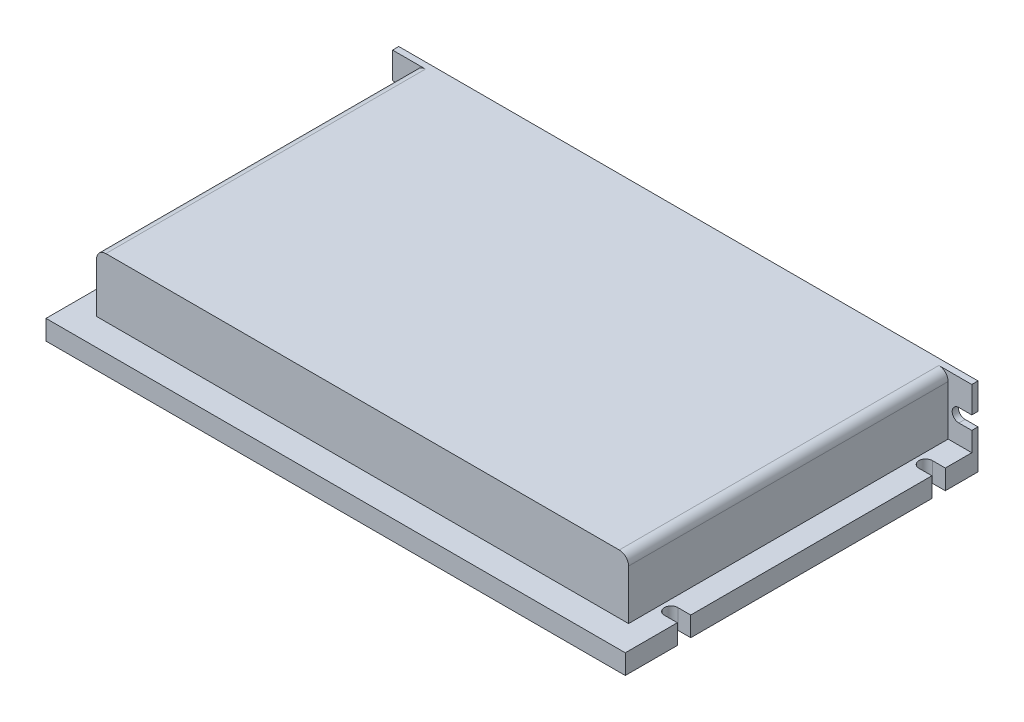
ISO-10303-21;
HEADER;
FILE_DESCRIPTION(('STEP AP214'),'2;1');
FILE_NAME('part.step','',(''),(''),'','','');
FILE_SCHEMA(('AUTOMOTIVE_DESIGN { 1 0 10303 214 1 1 1 1 }'));
ENDSEC;
DATA;
#1=APPLICATION_CONTEXT('core data for automotive mechanical design processes');
#2=APPLICATION_PROTOCOL_DEFINITION('international standard','automotive_design',2000,#1);
#3=PRODUCT_CONTEXT('',#1,'mechanical');
#4=PRODUCT('Part','Part','',(#3));
#5=PRODUCT_RELATED_PRODUCT_CATEGORY('part','',(#4));
#6=PRODUCT_DEFINITION_FORMATION('','',#4);
#7=PRODUCT_DEFINITION_CONTEXT('part definition',#1,'design');
#8=PRODUCT_DEFINITION('design','',#6,#7);
#9=PRODUCT_DEFINITION_SHAPE('','',#8);
#10=(LENGTH_UNIT() NAMED_UNIT(*) SI_UNIT(.MILLI.,.METRE.));
#11=(NAMED_UNIT(*) PLANE_ANGLE_UNIT() SI_UNIT($,.RADIAN.));
#12=(NAMED_UNIT(*) SI_UNIT($,.STERADIAN.) SOLID_ANGLE_UNIT());
#13=UNCERTAINTY_MEASURE_WITH_UNIT(LENGTH_MEASURE(1.E-05),#10,'distance_accuracy_value','');
#14=(GEOMETRIC_REPRESENTATION_CONTEXT(3) GLOBAL_UNCERTAINTY_ASSIGNED_CONTEXT((#13)) GLOBAL_UNIT_ASSIGNED_CONTEXT((#10,
#11,#12)) REPRESENTATION_CONTEXT('',''));
#15=CARTESIAN_POINT('',(0.,0.,0.));
#16=DIRECTION('',(0.,0.,1.));
#17=DIRECTION('',(1.,0.,0.));
#18=AXIS2_PLACEMENT_3D('',#15,#16,#17);
#19=CARTESIAN_POINT('',(126.69,-15.4,2.));
#20=DIRECTION('',(0.,-1.,0.));
#21=DIRECTION('',(1.,0.,0.));
#22=AXIS2_PLACEMENT_3D('',#19,#20,#21);
#23=PLANE('',#22);
#24=DIRECTION('',(0.,0.,-1.));
#25=VECTOR('',#24,1.);
#26=CARTESIAN_POINT('',(-60.,-15.4,2.));
#27=LINE('',#26,#25);
#28=CARTESIAN_POINT('',(-60.,-15.4,113.68));
#29=VERTEX_POINT('',#28);
#30=CARTESIAN_POINT('',(-60.,-15.4,96.9));
#31=VERTEX_POINT('',#30);
#32=EDGE_CURVE('E482',#29,#31,#27,.T.);
#33=ORIENTED_EDGE('',*,*,#32,.T.);
#34=DIRECTION('',(-1.,0.,0.));
#35=VECTOR('',#34,1.);
#36=CARTESIAN_POINT('',(-55.83,-15.4,96.9));
#37=LINE('',#36,#35);
#38=CARTESIAN_POINT('',(-55.83,-15.4,96.9));
#39=VERTEX_POINT('',#38);
#40=EDGE_CURVE('E270',#39,#31,#37,.T.);
#41=ORIENTED_EDGE('',*,*,#40,.F.);
#42=CARTESIAN_POINT('',(-55.83,-15.4,94.74));
#43=DIRECTION('',(0.,1.,0.));
#44=DIRECTION('',(-1.,0.,0.));
#45=AXIS2_PLACEMENT_3D('',#42,#43,#44);
#46=CIRCLE('',#45,2.16);
#47=CARTESIAN_POINT('',(-55.83,-15.4,92.58));
#48=VERTEX_POINT('',#47);
#49=EDGE_CURVE('E285',#39,#48,#46,.T.);
#50=ORIENTED_EDGE('',*,*,#49,.T.);
#51=DIRECTION('',(-1.,0.,0.));
#52=VECTOR('',#51,1.);
#53=CARTESIAN_POINT('',(-55.83,-15.4,92.58));
#54=LINE('',#53,#52);
#55=CARTESIAN_POINT('',(-60.,-15.4,92.58));
#56=VERTEX_POINT('',#55);
#57=EDGE_CURVE('E265',#48,#56,#54,.T.);
#58=ORIENTED_EDGE('',*,*,#57,.T.);
#59=CARTESIAN_POINT('',(-60.,-15.4,14.86));
#60=VERTEX_POINT('',#59);
#61=EDGE_CURVE('E486',#56,#60,#27,.T.);
#62=ORIENTED_EDGE('',*,*,#61,.T.);
#63=DIRECTION('',(-1.,0.,0.));
#64=VECTOR('',#63,1.);
#65=CARTESIAN_POINT('',(-55.83,-15.4,14.86));
#66=LINE('',#65,#64);
#67=CARTESIAN_POINT('',(-55.83,-15.4,14.86));
#68=VERTEX_POINT('',#67);
#69=EDGE_CURVE('E307',#68,#60,#66,.T.);
#70=ORIENTED_EDGE('',*,*,#69,.F.);
#71=CARTESIAN_POINT('',(-55.83,-15.4,12.7));
#72=DIRECTION('',(0.,1.,0.));
#73=DIRECTION('',(-1.,0.,0.));
#74=AXIS2_PLACEMENT_3D('',#71,#72,#73);
#75=CIRCLE('',#74,2.16);
#76=CARTESIAN_POINT('',(-55.83,-15.4,10.54));
#77=VERTEX_POINT('',#76);
#78=EDGE_CURVE('E301',#68,#77,#75,.T.);
#79=ORIENTED_EDGE('',*,*,#78,.T.);
#80=DIRECTION('',(-1.,0.,0.));
#81=VECTOR('',#80,1.);
#82=CARTESIAN_POINT('',(-55.83,-15.4,10.54));
#83=LINE('',#82,#81);
#84=CARTESIAN_POINT('',(-60.,-15.4,10.54));
#85=VERTEX_POINT('',#84);
#86=EDGE_CURVE('E304',#77,#85,#83,.T.);
#87=ORIENTED_EDGE('',*,*,#86,.T.);
#88=CARTESIAN_POINT('',(-60.,-15.4,0.));
#89=VERTEX_POINT('',#88);
#90=EDGE_CURVE('E480',#85,#89,#27,.T.);
#91=ORIENTED_EDGE('',*,*,#90,.T.);
#92=DIRECTION('',(-1.,0.,0.));
#93=VECTOR('',#92,1.);
#94=CARTESIAN_POINT('',(126.69,-15.4,0.));
#95=LINE('',#94,#93);
#96=CARTESIAN_POINT('',(126.69,-15.4,0.));
#97=VERTEX_POINT('',#96);
#98=EDGE_CURVE('E521',#97,#89,#95,.T.);
#99=ORIENTED_EDGE('',*,*,#98,.F.);
#100=DIRECTION('',(0.,0.,-1.));
#101=VECTOR('',#100,1.);
#102=CARTESIAN_POINT('',(126.69,-15.4,2.));
#103=LINE('',#102,#101);
#104=CARTESIAN_POINT('',(126.69,-15.4,10.54));
#105=VERTEX_POINT('',#104);
#106=EDGE_CURVE('E476',#105,#97,#103,.T.);
#107=ORIENTED_EDGE('',*,*,#106,.F.);
#108=DIRECTION('',(1.,0.,0.));
#109=VECTOR('',#108,1.);
#110=CARTESIAN_POINT('',(122.52,-15.4,10.54));
#111=LINE('',#110,#109);
#112=CARTESIAN_POINT('',(122.52,-15.4,10.54));
#113=VERTEX_POINT('',#112);
#114=EDGE_CURVE('E332',#113,#105,#111,.T.);
#115=ORIENTED_EDGE('',*,*,#114,.F.);
#116=CARTESIAN_POINT('',(122.52,-15.4,12.7));
#117=DIRECTION('',(0.,1.,0.));
#118=DIRECTION('',(-1.,0.,0.));
#119=AXIS2_PLACEMENT_3D('',#116,#117,#118);
#120=CIRCLE('',#119,2.16);
#121=CARTESIAN_POINT('',(122.52,-15.4,14.86));
#122=VERTEX_POINT('',#121);
#123=EDGE_CURVE('E326',#113,#122,#120,.T.);
#124=ORIENTED_EDGE('',*,*,#123,.T.);
#125=DIRECTION('',(1.,0.,0.));
#126=VECTOR('',#125,1.);
#127=CARTESIAN_POINT('',(122.52,-15.4,14.86));
#128=LINE('',#127,#126);
#129=CARTESIAN_POINT('',(126.69,-15.4,14.86));
#130=VERTEX_POINT('',#129);
#131=EDGE_CURVE('E329',#122,#130,#128,.T.);
#132=ORIENTED_EDGE('',*,*,#131,.T.);
#133=CARTESIAN_POINT('',(126.69,-15.4,92.58));
#134=VERTEX_POINT('',#133);
#135=EDGE_CURVE('E481',#134,#130,#103,.T.);
#136=ORIENTED_EDGE('',*,*,#135,.F.);
#137=DIRECTION('',(1.,0.,0.));
#138=VECTOR('',#137,1.);
#139=CARTESIAN_POINT('',(122.52,-15.4,92.58));
#140=LINE('',#139,#138);
#141=CARTESIAN_POINT('',(122.52,-15.4,92.58));
#142=VERTEX_POINT('',#141);
#143=EDGE_CURVE('E357',#142,#134,#140,.T.);
#144=ORIENTED_EDGE('',*,*,#143,.F.);
#145=CARTESIAN_POINT('',(122.52,-15.4,94.74));
#146=DIRECTION('',(0.,1.,0.));
#147=DIRECTION('',(-1.,0.,0.));
#148=AXIS2_PLACEMENT_3D('',#145,#146,#147);
#149=CIRCLE('',#148,2.16);
#150=CARTESIAN_POINT('',(122.52,-15.4,96.9));
#151=VERTEX_POINT('',#150);
#152=EDGE_CURVE('E351',#142,#151,#149,.T.);
#153=ORIENTED_EDGE('',*,*,#152,.T.);
#154=DIRECTION('',(1.,0.,0.));
#155=VECTOR('',#154,1.);
#156=CARTESIAN_POINT('',(122.52,-15.4,96.9));
#157=LINE('',#156,#155);
#158=CARTESIAN_POINT('',(126.69,-15.4,96.9));
#159=VERTEX_POINT('',#158);
#160=EDGE_CURVE('E354',#151,#159,#157,.T.);
#161=ORIENTED_EDGE('',*,*,#160,.T.);
#162=CARTESIAN_POINT('',(126.69,-15.4,113.68));
#163=VERTEX_POINT('',#162);
#164=EDGE_CURVE('E477',#163,#159,#103,.T.);
#165=ORIENTED_EDGE('',*,*,#164,.F.);
#166=DIRECTION('',(1.,0.,0.));
#167=VECTOR('',#166,1.);
#168=CARTESIAN_POINT('',(-60.,-15.4,113.68));
#169=LINE('',#168,#167);
#170=EDGE_CURVE('E432',#29,#163,#169,.T.);
#171=ORIENTED_EDGE('',*,*,#170,.F.);
#172=EDGE_LOOP('',(#33,#41,#50,#58,#62,#70,#79,#87,#91,#99,#107,#115,#124,#132,#136,#144,#153,
#161,#165,#171));
#173=FACE_BOUND('',#172,.T.);
#174=ADVANCED_FACE('F28',(#173),#23,.T.);
#175=CARTESIAN_POINT('',(126.69,-9.05000000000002,113.68));
#176=DIRECTION('',(0.,-1.,0.));
#177=DIRECTION('',(1.,0.,0.));
#178=AXIS2_PLACEMENT_3D('',#175,#176,#177);
#179=PLANE('',#178);
#180=DIRECTION('',(-1.,0.,0.));
#181=VECTOR('',#180,1.);
#182=CARTESIAN_POINT('',(-55.83,-9.05,96.9));
#183=LINE('',#182,#181);
#184=CARTESIAN_POINT('',(-55.83,-9.05,96.9));
#185=VERTEX_POINT('',#184);
#186=CARTESIAN_POINT('',(-60.,-9.05,96.9));
#187=VERTEX_POINT('',#186);
#188=EDGE_CURVE('E283',#185,#187,#183,.T.);
#189=ORIENTED_EDGE('',*,*,#188,.T.);
#190=DIRECTION('',(0.,0.,-1.));
#191=VECTOR('',#190,1.);
#192=CARTESIAN_POINT('',(-60.,-9.05,113.68));
#193=LINE('',#192,#191);
#194=CARTESIAN_POINT('',(-60.,-9.05,113.68));
#195=VERTEX_POINT('',#194);
#196=EDGE_CURVE('E430',#195,#187,#193,.T.);
#197=ORIENTED_EDGE('',*,*,#196,.F.);
#198=DIRECTION('',(-1.,0.,0.));
#199=VECTOR('',#198,1.);
#200=CARTESIAN_POINT('',(126.69,-9.05000000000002,113.68));
#201=LINE('',#200,#199);
#202=CARTESIAN_POINT('',(126.69,-9.05000000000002,113.68));
#203=VERTEX_POINT('',#202);
#204=EDGE_CURVE('E893',#203,#195,#201,.T.);
#205=ORIENTED_EDGE('',*,*,#204,.F.);
#206=DIRECTION('',(0.,0.,-1.));
#207=VECTOR('',#206,1.);
#208=CARTESIAN_POINT('',(126.69,-9.05000000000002,113.68));
#209=LINE('',#208,#207);
#210=CARTESIAN_POINT('',(126.69,-9.05000000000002,96.9));
#211=VERTEX_POINT('',#210);
#212=EDGE_CURVE('E428',#203,#211,#209,.T.);
#213=ORIENTED_EDGE('',*,*,#212,.T.);
#214=DIRECTION('',(1.,0.,0.));
#215=VECTOR('',#214,1.);
#216=CARTESIAN_POINT('',(122.52,-9.05000000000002,96.9));
#217=LINE('',#216,#215);
#218=CARTESIAN_POINT('',(122.52,-9.05000000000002,96.9));
#219=VERTEX_POINT('',#218);
#220=EDGE_CURVE('E346',#219,#211,#217,.T.);
#221=ORIENTED_EDGE('',*,*,#220,.F.);
#222=CARTESIAN_POINT('',(122.52,-9.05000000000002,94.74));
#223=DIRECTION('',(0.,1.,0.));
#224=DIRECTION('',(-1.,0.,0.));
#225=AXIS2_PLACEMENT_3D('',#222,#223,#224);
#226=CIRCLE('',#225,2.16);
#227=CARTESIAN_POINT('',(122.52,-9.05000000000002,92.58));
#228=VERTEX_POINT('',#227);
#229=EDGE_CURVE('E344',#228,#219,#226,.T.);
#230=ORIENTED_EDGE('',*,*,#229,.F.);
#231=DIRECTION('',(1.,0.,0.));
#232=VECTOR('',#231,1.);
#233=CARTESIAN_POINT('',(122.52,-9.05000000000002,92.58));
#234=LINE('',#233,#232);
#235=CARTESIAN_POINT('',(126.69,-9.05000000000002,92.58));
#236=VERTEX_POINT('',#235);
#237=EDGE_CURVE('E348',#228,#236,#234,.T.);
#238=ORIENTED_EDGE('',*,*,#237,.T.);
#239=CARTESIAN_POINT('',(126.69,-9.05000000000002,14.86));
#240=VERTEX_POINT('',#239);
#241=EDGE_CURVE('E425',#236,#240,#209,.T.);
#242=ORIENTED_EDGE('',*,*,#241,.T.);
#243=DIRECTION('',(1.,0.,0.));
#244=VECTOR('',#243,1.);
#245=CARTESIAN_POINT('',(122.52,-9.05000000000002,14.86));
#246=LINE('',#245,#244);
#247=CARTESIAN_POINT('',(122.52,-9.05000000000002,14.86));
#248=VERTEX_POINT('',#247);
#249=EDGE_CURVE('E321',#248,#240,#246,.T.);
#250=ORIENTED_EDGE('',*,*,#249,.F.);
#251=CARTESIAN_POINT('',(122.52,-9.05000000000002,12.7));
#252=DIRECTION('',(0.,1.,0.));
#253=DIRECTION('',(-1.,0.,0.));
#254=AXIS2_PLACEMENT_3D('',#251,#252,#253);
#255=CIRCLE('',#254,2.16);
#256=CARTESIAN_POINT('',(122.52,-9.05000000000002,10.54));
#257=VERTEX_POINT('',#256);
#258=EDGE_CURVE('E319',#257,#248,#255,.T.);
#259=ORIENTED_EDGE('',*,*,#258,.F.);
#260=DIRECTION('',(1.,0.,0.));
#261=VECTOR('',#260,1.);
#262=CARTESIAN_POINT('',(122.52,-9.05000000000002,10.54));
#263=LINE('',#262,#261);
#264=CARTESIAN_POINT('',(126.69,-9.05000000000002,10.54));
#265=VERTEX_POINT('',#264);
#266=EDGE_CURVE('E323',#257,#265,#263,.T.);
#267=ORIENTED_EDGE('',*,*,#266,.T.);
#268=CARTESIAN_POINT('',(126.69,-9.05000000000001,2.));
#269=VERTEX_POINT('',#268);
#270=EDGE_CURVE('E429',#265,#269,#209,.T.);
#271=ORIENTED_EDGE('',*,*,#270,.T.);
#272=DIRECTION('',(-1.,0.,0.));
#273=VECTOR('',#272,1.);
#274=CARTESIAN_POINT('',(126.69,-9.05000000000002,2.));
#275=LINE('',#274,#273);
#276=CARTESIAN_POINT('',(119.07,-9.05000000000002,2.));
#277=VERTEX_POINT('',#276);
#278=EDGE_CURVE('E418',#269,#277,#275,.T.);
#279=ORIENTED_EDGE('',*,*,#278,.T.);
#280=DIRECTION('',(0.,0.,-1.));
#281=VECTOR('',#280,1.);
#282=CARTESIAN_POINT('',(119.07,-9.05000000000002,105.));
#283=LINE('',#282,#281);
#284=CARTESIAN_POINT('',(119.07,-9.05000000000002,105.));
#285=VERTEX_POINT('',#284);
#286=EDGE_CURVE('E406',#285,#277,#283,.T.);
#287=ORIENTED_EDGE('',*,*,#286,.F.);
#288=DIRECTION('',(1.,0.,0.));
#289=VECTOR('',#288,1.);
#290=CARTESIAN_POINT('',(-52.38,-9.05000000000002,105.));
#291=LINE('',#290,#289);
#292=CARTESIAN_POINT('',(-52.38,-9.05,105.));
#293=VERTEX_POINT('',#292);
#294=EDGE_CURVE('E395',#293,#285,#291,.T.);
#295=ORIENTED_EDGE('',*,*,#294,.F.);
#296=DIRECTION('',(0.,0.,-1.));
#297=VECTOR('',#296,1.);
#298=CARTESIAN_POINT('',(-52.38,-9.05000000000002,105.));
#299=LINE('',#298,#297);
#300=CARTESIAN_POINT('',(-52.38,-9.05000000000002,2.));
#301=VERTEX_POINT('',#300);
#302=EDGE_CURVE('E408',#293,#301,#299,.T.);
#303=ORIENTED_EDGE('',*,*,#302,.T.);
#304=CARTESIAN_POINT('',(-60.,-9.05,2.));
#305=VERTEX_POINT('',#304);
#306=EDGE_CURVE('E411',#301,#305,#275,.T.);
#307=ORIENTED_EDGE('',*,*,#306,.T.);
#308=CARTESIAN_POINT('',(-60.,-9.05,10.54));
#309=VERTEX_POINT('',#308);
#310=EDGE_CURVE('E431',#309,#305,#193,.T.);
#311=ORIENTED_EDGE('',*,*,#310,.F.);
#312=DIRECTION('',(-1.,0.,0.));
#313=VECTOR('',#312,1.);
#314=CARTESIAN_POINT('',(-55.83,-9.05,10.54));
#315=LINE('',#314,#313);
#316=CARTESIAN_POINT('',(-55.83,-9.05,10.54));
#317=VERTEX_POINT('',#316);
#318=EDGE_CURVE('E54',#317,#309,#315,.T.);
#319=ORIENTED_EDGE('',*,*,#318,.F.);
#320=CARTESIAN_POINT('',(-55.83,-9.05,12.7));
#321=DIRECTION('',(0.,1.,0.));
#322=DIRECTION('',(-1.,0.,0.));
#323=AXIS2_PLACEMENT_3D('',#320,#321,#322);
#324=CIRCLE('',#323,2.16);
#325=CARTESIAN_POINT('',(-55.83,-9.05,14.86));
#326=VERTEX_POINT('',#325);
#327=EDGE_CURVE('E295',#326,#317,#324,.T.);
#328=ORIENTED_EDGE('',*,*,#327,.F.);
#329=DIRECTION('',(-1.,0.,0.));
#330=VECTOR('',#329,1.);
#331=CARTESIAN_POINT('',(-55.83,-9.05,14.86));
#332=LINE('',#331,#330);
#333=CARTESIAN_POINT('',(-60.,-9.05,14.86));
#334=VERTEX_POINT('',#333);
#335=EDGE_CURVE('E299',#326,#334,#332,.T.);
#336=ORIENTED_EDGE('',*,*,#335,.T.);
#337=CARTESIAN_POINT('',(-60.,-9.05,92.58));
#338=VERTEX_POINT('',#337);
#339=EDGE_CURVE('E32',#338,#334,#193,.T.);
#340=ORIENTED_EDGE('',*,*,#339,.F.);
#341=DIRECTION('',(-1.,0.,0.));
#342=VECTOR('',#341,1.);
#343=CARTESIAN_POINT('',(-55.83,-9.05,92.58));
#344=LINE('',#343,#342);
#345=CARTESIAN_POINT('',(-55.83,-9.05,92.58));
#346=VERTEX_POINT('',#345);
#347=EDGE_CURVE('E46',#346,#338,#344,.T.);
#348=ORIENTED_EDGE('',*,*,#347,.F.);
#349=CARTESIAN_POINT('',(-55.83,-9.05,94.74));
#350=DIRECTION('',(0.,1.,0.));
#351=DIRECTION('',(-1.,0.,0.));
#352=AXIS2_PLACEMENT_3D('',#349,#350,#351);
#353=CIRCLE('',#352,2.16);
#354=EDGE_CURVE('E273',#185,#346,#353,.T.);
#355=ORIENTED_EDGE('',*,*,#354,.F.);
#356=EDGE_LOOP('',(#189,#197,#205,#213,#221,#230,#238,#242,#250,#259,#267,#271,#279,#287,#295,
#303,#307,#311,#319,#328,#336,#340,#348,#355));
#357=FACE_BOUND('',#356,.T.);
#358=ADVANCED_FACE('F281',(#357),#179,.F.);
#359=CARTESIAN_POINT('',(-60.,-2.825,2.));
#360=DIRECTION('',(1.,0.,0.));
#361=DIRECTION('',(0.,1.,0.));
#362=AXIS2_PLACEMENT_3D('',#359,#360,#361);
#363=PLANE('',#362);
#364=DIRECTION('',(0.,1.,0.));
#365=VECTOR('',#364,1.);
#366=CARTESIAN_POINT('',(-60.,-15.4,96.9));
#367=LINE('',#366,#365);
#368=EDGE_CURVE('E292',#31,#187,#367,.T.);
#369=ORIENTED_EDGE('',*,*,#368,.F.);
#370=ORIENTED_EDGE('',*,*,#32,.F.);
#371=DIRECTION('',(0.,1.,0.));
#372=VECTOR('',#371,1.);
#373=CARTESIAN_POINT('',(-60.,-15.4,113.68));
#374=LINE('',#373,#372);
#375=EDGE_CURVE('E414',#29,#195,#374,.T.);
#376=ORIENTED_EDGE('',*,*,#375,.T.);
#377=ORIENTED_EDGE('',*,*,#196,.T.);
#378=EDGE_LOOP('',(#369,#370,#376,#377));
#379=FACE_BOUND('',#378,.T.);
#380=ADVANCED_FACE('F591',(#379),#363,.F.);
#381=ORIENTED_EDGE('',*,*,#61,.F.);
#382=DIRECTION('',(0.,1.,0.));
#383=VECTOR('',#382,1.);
#384=CARTESIAN_POINT('',(-60.,-15.4,92.58));
#385=LINE('',#384,#383);
#386=EDGE_CURVE('E269',#56,#338,#385,.T.);
#387=ORIENTED_EDGE('',*,*,#386,.T.);
#388=ORIENTED_EDGE('',*,*,#339,.T.);
#389=DIRECTION('',(0.,1.,0.));
#390=VECTOR('',#389,1.);
#391=CARTESIAN_POINT('',(-60.,-15.4,14.86));
#392=LINE('',#391,#390);
#393=EDGE_CURVE('E314',#60,#334,#392,.T.);
#394=ORIENTED_EDGE('',*,*,#393,.F.);
#395=EDGE_LOOP('',(#381,#387,#388,#394));
#396=FACE_BOUND('',#395,.T.);
#397=ADVANCED_FACE('F588',(#396),#363,.F.);
#398=CARTESIAN_POINT('',(126.69,-15.4,2.));
#399=DIRECTION('',(-1.,0.,0.));
#400=DIRECTION('',(0.,-1.,0.));
#401=AXIS2_PLACEMENT_3D('',#398,#399,#400);
#402=PLANE('',#401);
#403=DIRECTION('',(0.,1.,0.));
#404=VECTOR('',#403,1.);
#405=CARTESIAN_POINT('',(126.69,-15.4,10.54));
#406=LINE('',#405,#404);
#407=EDGE_CURVE('E340',#105,#265,#406,.T.);
#408=ORIENTED_EDGE('',*,*,#407,.F.);
#409=ORIENTED_EDGE('',*,*,#106,.T.);
#410=DIRECTION('',(0.,1.,0.));
#411=VECTOR('',#410,1.);
#412=CARTESIAN_POINT('',(126.69,-15.4,0.));
#413=LINE('',#412,#411);
#414=CARTESIAN_POINT('',(126.69,-2.825,0.));
#415=VERTEX_POINT('',#414);
#416=EDGE_CURVE('E524',#97,#415,#413,.T.);
#417=ORIENTED_EDGE('',*,*,#416,.T.);
#418=DIRECTION('',(0.,0.,-1.));
#419=VECTOR('',#418,1.);
#420=CARTESIAN_POINT('',(126.69,-2.825,2.));
#421=LINE('',#420,#419);
#422=CARTESIAN_POINT('',(126.69,-2.825,2.));
#423=VERTEX_POINT('',#422);
#424=EDGE_CURVE('E474',#423,#415,#421,.T.);
#425=ORIENTED_EDGE('',*,*,#424,.F.);
#426=DIRECTION('',(0.,1.,0.));
#427=VECTOR('',#426,1.);
#428=CARTESIAN_POINT('',(126.69,-15.4,2.));
#429=LINE('',#428,#427);
#430=EDGE_CURVE('E439',#269,#423,#429,.T.);
#431=ORIENTED_EDGE('',*,*,#430,.F.);
#432=ORIENTED_EDGE('',*,*,#270,.F.);
#433=EDGE_LOOP('',(#408,#409,#417,#425,#431,#432));
#434=FACE_BOUND('',#433,.T.);
#435=ADVANCED_FACE('F590',(#434),#402,.F.);
#436=ORIENTED_EDGE('',*,*,#135,.T.);
#437=DIRECTION('',(0.,1.,0.));
#438=VECTOR('',#437,1.);
#439=CARTESIAN_POINT('',(126.69,-15.4,14.86));
#440=LINE('',#439,#438);
#441=EDGE_CURVE('E337',#130,#240,#440,.T.);
#442=ORIENTED_EDGE('',*,*,#441,.T.);
#443=ORIENTED_EDGE('',*,*,#241,.F.);
#444=DIRECTION('',(0.,1.,0.));
#445=VECTOR('',#444,1.);
#446=CARTESIAN_POINT('',(126.69,-15.4,92.58));
#447=LINE('',#446,#445);
#448=EDGE_CURVE('E365',#134,#236,#447,.T.);
#449=ORIENTED_EDGE('',*,*,#448,.F.);
#450=EDGE_LOOP('',(#436,#442,#443,#449));
#451=FACE_BOUND('',#450,.T.);
#452=ADVANCED_FACE('F597',(#451),#402,.F.);
#453=CARTESIAN_POINT('',(-55.83,-0.669999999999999,2.));
#454=DIRECTION('',(0.,0.,1.));
#455=DIRECTION('',(1.,0.,0.));
#456=AXIS2_PLACEMENT_3D('',#453,#454,#455);
#457=PLANE('',#456);
#458=DIRECTION('',(0.,-1.,0.));
#459=VECTOR('',#458,1.);
#460=CARTESIAN_POINT('',(119.07,6.99999999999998,2.));
#461=LINE('',#460,#459);
#462=CARTESIAN_POINT('',(119.07,6.99999999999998,2.));
#463=VERTEX_POINT('',#462);
#464=EDGE_CURVE('E378',#463,#277,#461,.T.);
#465=ORIENTED_EDGE('',*,*,#464,.T.);
#466=ORIENTED_EDGE('',*,*,#278,.F.);
#467=ORIENTED_EDGE('',*,*,#430,.T.);
#468=DIRECTION('',(1.,0.,0.));
#469=VECTOR('',#468,1.);
#470=CARTESIAN_POINT('',(122.52,-2.825,2.));
#471=LINE('',#470,#469);
#472=CARTESIAN_POINT('',(122.52,-2.82500000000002,2.));
#473=VERTEX_POINT('',#472);
#474=EDGE_CURVE('E442',#473,#423,#471,.T.);
#475=ORIENTED_EDGE('',*,*,#474,.F.);
#476=CARTESIAN_POINT('',(122.52,-0.670000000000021,2.));
#477=DIRECTION('',(0.,0.,1.));
#478=DIRECTION('',(1.,0.,0.));
#479=AXIS2_PLACEMENT_3D('',#476,#477,#478);
#480=CIRCLE('',#479,2.155);
#481=CARTESIAN_POINT('',(122.52,1.485,2.));
#482=VERTEX_POINT('',#481);
#483=EDGE_CURVE('E451',#482,#473,#480,.T.);
#484=ORIENTED_EDGE('',*,*,#483,.F.);
#485=DIRECTION('',(1.,0.,0.));
#486=VECTOR('',#485,1.);
#487=CARTESIAN_POINT('',(122.52,1.485,2.));
#488=LINE('',#487,#486);
#489=CARTESIAN_POINT('',(126.69,1.485,2.));
#490=VERTEX_POINT('',#489);
#491=EDGE_CURVE('E454',#482,#490,#488,.T.);
#492=ORIENTED_EDGE('',*,*,#491,.T.);
#493=DIRECTION('',(0.,1.,0.));
#494=VECTOR('',#493,1.);
#495=CARTESIAN_POINT('',(126.69,1.485,2.));
#496=LINE('',#495,#494);
#497=CARTESIAN_POINT('',(126.69,10.,2.));
#498=VERTEX_POINT('',#497);
#499=EDGE_CURVE('E457',#490,#498,#496,.T.);
#500=ORIENTED_EDGE('',*,*,#499,.T.);
#501=DIRECTION('',(1.,0.,0.));
#502=VECTOR('',#501,1.);
#503=CARTESIAN_POINT('',(-60.,10.,2.));
#504=LINE('',#503,#502);
#505=CARTESIAN_POINT('',(116.07,10.,2.));
#506=VERTEX_POINT('',#505);
#507=EDGE_CURVE('E460',#506,#498,#504,.T.);
#508=ORIENTED_EDGE('',*,*,#507,.F.);
#509=CARTESIAN_POINT('',(116.07,7.,2.));
#510=DIRECTION('',(0.,0.,1.));
#511=DIRECTION('',(1.,0.,0.));
#512=AXIS2_PLACEMENT_3D('',#509,#510,#511);
#513=CIRCLE('',#512,3.);
#514=EDGE_CURVE('E375',#463,#506,#513,.T.);
#515=ORIENTED_EDGE('',*,*,#514,.F.);
#516=EDGE_LOOP('',(#465,#466,#467,#475,#484,#492,#500,#508,#515));
#517=FACE_BOUND('',#516,.T.);
#518=ADVANCED_FACE('F633',(#517),#457,.T.);
#519=CARTESIAN_POINT('',(-60.,10.,2.));
#520=DIRECTION('',(1.,0.,0.));
#521=DIRECTION('',(0.,1.,0.));
#522=AXIS2_PLACEMENT_3D('',#519,#520,#521);
#523=PLANE('',#522);
#524=DIRECTION('',(0.,0.,-1.));
#525=VECTOR('',#524,1.);
#526=CARTESIAN_POINT('',(-60.,1.485,2.));
#527=LINE('',#526,#525);
#528=CARTESIAN_POINT('',(-60.,1.485,2.));
#529=VERTEX_POINT('',#528);
#530=CARTESIAN_POINT('',(-60.,1.485,0.));
#531=VERTEX_POINT('',#530);
#532=EDGE_CURVE('E11',#529,#531,#527,.T.);
#533=ORIENTED_EDGE('',*,*,#532,.F.);
#534=DIRECTION('',(0.,-1.,0.));
#535=VECTOR('',#534,1.);
#536=CARTESIAN_POINT('',(-60.,10.,2.));
#537=LINE('',#536,#535);
#538=CARTESIAN_POINT('',(-60.,10.,2.));
#539=VERTEX_POINT('',#538);
#540=EDGE_CURVE('E542',#539,#529,#537,.T.);
#541=ORIENTED_EDGE('',*,*,#540,.F.);
#542=DIRECTION('',(0.,0.,-1.));
#543=VECTOR('',#542,1.);
#544=CARTESIAN_POINT('',(-60.,10.,2.));
#545=LINE('',#544,#543);
#546=CARTESIAN_POINT('',(-60.,10.,0.));
#547=VERTEX_POINT('',#546);
#548=EDGE_CURVE('E464',#539,#547,#545,.T.);
#549=ORIENTED_EDGE('',*,*,#548,.T.);
#550=DIRECTION('',(0.,-1.,0.));
#551=VECTOR('',#550,1.);
#552=CARTESIAN_POINT('',(-60.,10.,0.));
#553=LINE('',#552,#551);
#554=EDGE_CURVE('E508',#547,#531,#553,.T.);
#555=ORIENTED_EDGE('',*,*,#554,.T.);
#556=EDGE_LOOP('',(#533,#541,#549,#555));
#557=FACE_BOUND('',#556,.T.);
#558=ADVANCED_FACE('F574',(#557),#523,.F.);
#559=CARTESIAN_POINT('',(-55.83,1.485,2.));
#560=DIRECTION('',(0.,-1.,0.));
#561=DIRECTION('',(1.,0.,0.));
#562=AXIS2_PLACEMENT_3D('',#559,#560,#561);
#563=PLANE('',#562);
#564=DIRECTION('',(0.,0.,-1.));
#565=VECTOR('',#564,1.);
#566=CARTESIAN_POINT('',(-55.83,1.485,2.));
#567=LINE('',#566,#565);
#568=CARTESIAN_POINT('',(-55.83,1.485,2.));
#569=VERTEX_POINT('',#568);
#570=CARTESIAN_POINT('',(-55.83,1.485,0.));
#571=VERTEX_POINT('',#570);
#572=EDGE_CURVE('E38',#569,#571,#567,.T.);
#573=ORIENTED_EDGE('',*,*,#572,.F.);
#574=DIRECTION('',(-1.,0.,0.));
#575=VECTOR('',#574,1.);
#576=CARTESIAN_POINT('',(-55.83,1.485,2.));
#577=LINE('',#576,#575);
#578=EDGE_CURVE('E545',#569,#529,#577,.T.);
#579=ORIENTED_EDGE('',*,*,#578,.T.);
#580=ORIENTED_EDGE('',*,*,#532,.T.);
#581=DIRECTION('',(-1.,0.,0.));
#582=VECTOR('',#581,1.);
#583=CARTESIAN_POINT('',(-55.83,1.485,0.));
#584=LINE('',#583,#582);
#585=EDGE_CURVE('E504',#571,#531,#584,.T.);
#586=ORIENTED_EDGE('',*,*,#585,.F.);
#587=EDGE_LOOP('',(#573,#579,#580,#586));
#588=FACE_BOUND('',#587,.T.);
#589=ADVANCED_FACE('F30',(#588),#563,.T.);
#590=CARTESIAN_POINT('',(-55.83,-0.669999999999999,2.));
#591=DIRECTION('',(0.,0.,-1.));
#592=DIRECTION('',(-1.,0.,0.));
#593=AXIS2_PLACEMENT_3D('',#590,#591,#592);
#594=CYLINDRICAL_SURFACE('',#593,2.155);
#595=DIRECTION('',(0.,0.,-1.));
#596=VECTOR('',#595,1.);
#597=CARTESIAN_POINT('',(-55.83,-2.825,2.));
#598=LINE('',#597,#596);
#599=CARTESIAN_POINT('',(-55.83,-2.825,2.));
#600=VERTEX_POINT('',#599);
#601=CARTESIAN_POINT('',(-55.83,-2.825,0.));
#602=VERTEX_POINT('',#601);
#603=EDGE_CURVE('E488',#600,#602,#598,.T.);
#604=ORIENTED_EDGE('',*,*,#603,.F.);
#605=CARTESIAN_POINT('',(-55.83,-0.669999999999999,2.));
#606=DIRECTION('',(0.,0.,1.));
#607=DIRECTION('',(1.,0.,0.));
#608=AXIS2_PLACEMENT_3D('',#605,#606,#607);
#609=CIRCLE('',#608,2.155);
#610=EDGE_CURVE('E499',#600,#569,#609,.T.);
#611=ORIENTED_EDGE('',*,*,#610,.T.);
#612=ORIENTED_EDGE('',*,*,#572,.T.);
#613=CARTESIAN_POINT('',(-55.83,-0.669999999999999,0.));
#614=DIRECTION('',(0.,0.,1.));
#615=DIRECTION('',(1.,0.,0.));
#616=AXIS2_PLACEMENT_3D('',#613,#614,#615);
#617=CIRCLE('',#616,2.155);
#618=EDGE_CURVE('E496',#602,#571,#617,.T.);
#619=ORIENTED_EDGE('',*,*,#618,.F.);
#620=EDGE_LOOP('',(#604,#611,#612,#619));
#621=FACE_BOUND('',#620,.T.);
#622=ADVANCED_FACE('F494',(#621),#594,.F.);
#623=CARTESIAN_POINT('',(-55.83,-2.825,2.));
#624=DIRECTION('',(0.,-1.,0.));
#625=DIRECTION('',(1.,0.,0.));
#626=AXIS2_PLACEMENT_3D('',#623,#624,#625);
#627=PLANE('',#626);
#628=DIRECTION('',(0.,0.,-1.));
#629=VECTOR('',#628,1.);
#630=CARTESIAN_POINT('',(-60.,-2.825,2.));
#631=LINE('',#630,#629);
#632=CARTESIAN_POINT('',(-60.,-2.825,2.));
#633=VERTEX_POINT('',#632);
#634=CARTESIAN_POINT('',(-60.,-2.825,0.));
#635=VERTEX_POINT('',#634);
#636=EDGE_CURVE('E485',#633,#635,#631,.T.);
#637=ORIENTED_EDGE('',*,*,#636,.F.);
#638=DIRECTION('',(-1.,0.,0.));
#639=VECTOR('',#638,1.);
#640=CARTESIAN_POINT('',(-55.83,-2.825,2.));
#641=LINE('',#640,#639);
#642=EDGE_CURVE('E547',#600,#633,#641,.T.);
#643=ORIENTED_EDGE('',*,*,#642,.F.);
#644=ORIENTED_EDGE('',*,*,#603,.T.);
#645=DIRECTION('',(-1.,0.,0.));
#646=VECTOR('',#645,1.);
#647=CARTESIAN_POINT('',(-55.83,-2.825,0.));
#648=LINE('',#647,#646);
#649=EDGE_CURVE('E513',#602,#635,#648,.T.);
#650=ORIENTED_EDGE('',*,*,#649,.T.);
#651=EDGE_LOOP('',(#637,#643,#644,#650));
#652=FACE_BOUND('',#651,.T.);
#653=ADVANCED_FACE('F576',(#652),#627,.F.);
#654=ORIENTED_EDGE('',*,*,#90,.F.);
#655=DIRECTION('',(0.,1.,0.));
#656=VECTOR('',#655,1.);
#657=CARTESIAN_POINT('',(-60.,-15.4,10.54));
#658=LINE('',#657,#656);
#659=EDGE_CURVE('E312',#85,#309,#658,.T.);
#660=ORIENTED_EDGE('',*,*,#659,.T.);
#661=ORIENTED_EDGE('',*,*,#310,.T.);
#662=DIRECTION('',(0.,-1.,0.));
#663=VECTOR('',#662,1.);
#664=CARTESIAN_POINT('',(-60.,-2.825,2.));
#665=LINE('',#664,#663);
#666=EDGE_CURVE('E443',#633,#305,#665,.T.);
#667=ORIENTED_EDGE('',*,*,#666,.F.);
#668=ORIENTED_EDGE('',*,*,#636,.T.);
#669=DIRECTION('',(0.,-1.,0.));
#670=VECTOR('',#669,1.);
#671=CARTESIAN_POINT('',(-60.,-2.825,0.));
#672=LINE('',#671,#670);
#673=EDGE_CURVE('E515',#635,#89,#672,.T.);
#674=ORIENTED_EDGE('',*,*,#673,.T.);
#675=EDGE_LOOP('',(#654,#660,#661,#667,#668,#674));
#676=FACE_BOUND('',#675,.T.);
#677=ADVANCED_FACE('F557',(#676),#363,.F.);
#678=ORIENTED_EDGE('',*,*,#164,.T.);
#679=DIRECTION('',(0.,1.,0.));
#680=VECTOR('',#679,1.);
#681=CARTESIAN_POINT('',(126.69,-15.4,96.9));
#682=LINE('',#681,#680);
#683=EDGE_CURVE('E362',#159,#211,#682,.T.);
#684=ORIENTED_EDGE('',*,*,#683,.T.);
#685=ORIENTED_EDGE('',*,*,#212,.F.);
#686=DIRECTION('',(0.,-1.,0.));
#687=VECTOR('',#686,1.);
#688=CARTESIAN_POINT('',(126.69,-9.05000000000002,113.68));
#689=LINE('',#688,#687);
#690=EDGE_CURVE('E896',#203,#163,#689,.T.);
#691=ORIENTED_EDGE('',*,*,#690,.T.);
#692=EDGE_LOOP('',(#678,#684,#685,#691));
#693=FACE_BOUND('',#692,.T.);
#694=ADVANCED_FACE('F600',(#693),#402,.F.);
#695=CARTESIAN_POINT('',(122.52,-2.825,2.));
#696=DIRECTION('',(0.,1.,0.));
#697=DIRECTION('',(0.,0.,1.));
#698=AXIS2_PLACEMENT_3D('',#695,#696,#697);
#699=PLANE('',#698);
#700=DIRECTION('',(0.,0.,-1.));
#701=VECTOR('',#700,1.);
#702=CARTESIAN_POINT('',(122.52,-2.82500000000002,2.));
#703=LINE('',#702,#701);
#704=CARTESIAN_POINT('',(122.52,-2.82500000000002,0.));
#705=VERTEX_POINT('',#704);
#706=EDGE_CURVE('E472',#473,#705,#703,.T.);
#707=ORIENTED_EDGE('',*,*,#706,.F.);
#708=ORIENTED_EDGE('',*,*,#474,.T.);
#709=ORIENTED_EDGE('',*,*,#424,.T.);
#710=DIRECTION('',(1.,0.,0.));
#711=VECTOR('',#710,1.);
#712=CARTESIAN_POINT('',(122.52,-2.825,0.));
#713=LINE('',#712,#711);
#714=EDGE_CURVE('E527',#705,#415,#713,.T.);
#715=ORIENTED_EDGE('',*,*,#714,.F.);
#716=EDGE_LOOP('',(#707,#708,#709,#715));
#717=FACE_BOUND('',#716,.T.);
#718=ADVANCED_FACE('F612',(#717),#699,.T.);
#719=CARTESIAN_POINT('',(122.52,-0.670000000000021,2.));
#720=DIRECTION('',(0.,0.,-1.));
#721=DIRECTION('',(-1.,0.,0.));
#722=AXIS2_PLACEMENT_3D('',#719,#720,#721);
#723=CYLINDRICAL_SURFACE('',#722,2.155);
#724=DIRECTION('',(0.,0.,-1.));
#725=VECTOR('',#724,1.);
#726=CARTESIAN_POINT('',(122.52,1.485,2.));
#727=LINE('',#726,#725);
#728=CARTESIAN_POINT('',(122.52,1.485,0.));
#729=VERTEX_POINT('',#728);
#730=EDGE_CURVE('E470',#482,#729,#727,.T.);
#731=ORIENTED_EDGE('',*,*,#730,.F.);
#732=ORIENTED_EDGE('',*,*,#483,.T.);
#733=ORIENTED_EDGE('',*,*,#706,.T.);
#734=CARTESIAN_POINT('',(122.52,-0.670000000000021,0.));
#735=DIRECTION('',(0.,0.,1.));
#736=DIRECTION('',(1.,0.,0.));
#737=AXIS2_PLACEMENT_3D('',#734,#735,#736);
#738=CIRCLE('',#737,2.155);
#739=EDGE_CURVE('E530',#729,#705,#738,.T.);
#740=ORIENTED_EDGE('',*,*,#739,.F.);
#741=EDGE_LOOP('',(#731,#732,#733,#740));
#742=FACE_BOUND('',#741,.T.);
#743=ADVANCED_FACE('F616',(#742),#723,.F.);
#744=CARTESIAN_POINT('',(122.52,1.485,2.));
#745=DIRECTION('',(0.,1.,0.));
#746=DIRECTION('',(0.,0.,1.));
#747=AXIS2_PLACEMENT_3D('',#744,#745,#746);
#748=PLANE('',#747);
#749=DIRECTION('',(0.,0.,-1.));
#750=VECTOR('',#749,1.);
#751=CARTESIAN_POINT('',(126.69,1.485,2.));
#752=LINE('',#751,#750);
#753=CARTESIAN_POINT('',(126.69,1.485,0.));
#754=VERTEX_POINT('',#753);
#755=EDGE_CURVE('E468',#490,#754,#752,.T.);
#756=ORIENTED_EDGE('',*,*,#755,.F.);
#757=ORIENTED_EDGE('',*,*,#491,.F.);
#758=ORIENTED_EDGE('',*,*,#730,.T.);
#759=DIRECTION('',(1.,0.,0.));
#760=VECTOR('',#759,1.);
#761=CARTESIAN_POINT('',(122.52,1.485,0.));
#762=LINE('',#761,#760);
#763=EDGE_CURVE('E533',#729,#754,#762,.T.);
#764=ORIENTED_EDGE('',*,*,#763,.T.);
#765=EDGE_LOOP('',(#756,#757,#758,#764));
#766=FACE_BOUND('',#765,.T.);
#767=ADVANCED_FACE('F620',(#766),#748,.F.);
#768=CARTESIAN_POINT('',(126.69,1.485,2.));
#769=DIRECTION('',(-1.,0.,0.));
#770=DIRECTION('',(0.,0.,1.));
#771=AXIS2_PLACEMENT_3D('',#768,#769,#770);
#772=PLANE('',#771);
#773=DIRECTION('',(0.,0.,-1.));
#774=VECTOR('',#773,1.);
#775=CARTESIAN_POINT('',(126.69,10.,2.));
#776=LINE('',#775,#774);
#777=CARTESIAN_POINT('',(126.69,10.,0.));
#778=VERTEX_POINT('',#777);
#779=EDGE_CURVE('E466',#498,#778,#776,.T.);
#780=ORIENTED_EDGE('',*,*,#779,.F.);
#781=ORIENTED_EDGE('',*,*,#499,.F.);
#782=ORIENTED_EDGE('',*,*,#755,.T.);
#783=DIRECTION('',(0.,1.,0.));
#784=VECTOR('',#783,1.);
#785=CARTESIAN_POINT('',(126.69,1.485,0.));
#786=LINE('',#785,#784);
#787=EDGE_CURVE('E536',#754,#778,#786,.T.);
#788=ORIENTED_EDGE('',*,*,#787,.T.);
#789=EDGE_LOOP('',(#780,#781,#782,#788));
#790=FACE_BOUND('',#789,.T.);
#791=ADVANCED_FACE('F624',(#790),#772,.F.);
#792=CARTESIAN_POINT('',(-60.,10.,2.));
#793=DIRECTION('',(0.,1.,0.));
#794=DIRECTION('',(0.,0.,1.));
#795=AXIS2_PLACEMENT_3D('',#792,#793,#794);
#796=PLANE('',#795);
#797=CARTESIAN_POINT('',(-49.38,10.,2.));
#798=VERTEX_POINT('',#797);
#799=EDGE_CURVE('E461',#539,#798,#504,.T.);
#800=ORIENTED_EDGE('',*,*,#799,.T.);
#801=DIRECTION('',(0.,0.,-1.));
#802=VECTOR('',#801,1.);
#803=CARTESIAN_POINT('',(-49.38,10.,105.));
#804=LINE('',#803,#802);
#805=CARTESIAN_POINT('',(-49.38,10.,105.));
#806=VERTEX_POINT('',#805);
#807=EDGE_CURVE('E400',#806,#798,#804,.T.);
#808=ORIENTED_EDGE('',*,*,#807,.F.);
#809=DIRECTION('',(-1.,0.,0.));
#810=VECTOR('',#809,1.);
#811=CARTESIAN_POINT('',(116.07,10.,105.));
#812=LINE('',#811,#810);
#813=CARTESIAN_POINT('',(116.07,10.,105.));
#814=VERTEX_POINT('',#813);
#815=EDGE_CURVE('E387',#814,#806,#812,.T.);
#816=ORIENTED_EDGE('',*,*,#815,.F.);
#817=DIRECTION('',(0.,0.,-1.));
#818=VECTOR('',#817,1.);
#819=CARTESIAN_POINT('',(116.07,10.,105.));
#820=LINE('',#819,#818);
#821=EDGE_CURVE('E402',#814,#506,#820,.T.);
#822=ORIENTED_EDGE('',*,*,#821,.T.);
#823=ORIENTED_EDGE('',*,*,#507,.T.);
#824=ORIENTED_EDGE('',*,*,#779,.T.);
#825=DIRECTION('',(1.,0.,0.));
#826=VECTOR('',#825,1.);
#827=CARTESIAN_POINT('',(-60.,10.,0.));
#828=LINE('',#827,#826);
#829=EDGE_CURVE('E539',#547,#778,#828,.T.);
#830=ORIENTED_EDGE('',*,*,#829,.F.);
#831=ORIENTED_EDGE('',*,*,#548,.F.);
#832=EDGE_LOOP('',(#800,#808,#816,#822,#823,#824,#830,#831));
#833=FACE_BOUND('',#832,.T.);
#834=ADVANCED_FACE('F568',(#833),#796,.T.);
#835=DIRECTION('',(0.,1.,0.));
#836=VECTOR('',#835,1.);
#837=CARTESIAN_POINT('',(-52.38,-9.05000000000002,2.));
#838=LINE('',#837,#836);
#839=CARTESIAN_POINT('',(-52.38,7.00000000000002,2.));
#840=VERTEX_POINT('',#839);
#841=EDGE_CURVE('E369',#301,#840,#838,.T.);
#842=ORIENTED_EDGE('',*,*,#841,.T.);
#843=CARTESIAN_POINT('',(-49.38,7.00000000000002,2.));
#844=DIRECTION('',(0.,0.,1.));
#845=DIRECTION('',(1.,0.,0.));
#846=AXIS2_PLACEMENT_3D('',#843,#844,#845);
#847=CIRCLE('',#846,3.);
#848=EDGE_CURVE('E372',#798,#840,#847,.T.);
#849=ORIENTED_EDGE('',*,*,#848,.F.);
#850=ORIENTED_EDGE('',*,*,#799,.F.);
#851=ORIENTED_EDGE('',*,*,#540,.T.);
#852=ORIENTED_EDGE('',*,*,#578,.F.);
#853=ORIENTED_EDGE('',*,*,#610,.F.);
#854=ORIENTED_EDGE('',*,*,#642,.T.);
#855=ORIENTED_EDGE('',*,*,#666,.T.);
#856=ORIENTED_EDGE('',*,*,#306,.F.);
#857=EDGE_LOOP('',(#842,#849,#850,#851,#852,#853,#854,#855,#856));
#858=FACE_BOUND('',#857,.T.);
#859=ADVANCED_FACE('F554',(#858),#457,.T.);
#860=CARTESIAN_POINT('',(-55.83,-0.669999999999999,0.));
#861=DIRECTION('',(0.,0.,1.));
#862=DIRECTION('',(1.,0.,0.));
#863=AXIS2_PLACEMENT_3D('',#860,#861,#862);
#864=PLANE('',#863);
#865=ORIENTED_EDGE('',*,*,#554,.F.);
#866=ORIENTED_EDGE('',*,*,#829,.T.);
#867=ORIENTED_EDGE('',*,*,#787,.F.);
#868=ORIENTED_EDGE('',*,*,#763,.F.);
#869=ORIENTED_EDGE('',*,*,#739,.T.);
#870=ORIENTED_EDGE('',*,*,#714,.T.);
#871=ORIENTED_EDGE('',*,*,#416,.F.);
#872=ORIENTED_EDGE('',*,*,#98,.T.);
#873=ORIENTED_EDGE('',*,*,#673,.F.);
#874=ORIENTED_EDGE('',*,*,#649,.F.);
#875=ORIENTED_EDGE('',*,*,#618,.T.);
#876=ORIENTED_EDGE('',*,*,#585,.T.);
#877=EDGE_LOOP('',(#865,#866,#867,#868,#869,#870,#871,#872,#873,#874,#875,#876));
#878=FACE_BOUND('',#877,.T.);
#879=ADVANCED_FACE('F510',(#878),#864,.F.);
#880=CARTESIAN_POINT('',(-60.,-15.4,113.68));
#881=DIRECTION('',(0.,0.,-1.));
#882=DIRECTION('',(-1.,0.,0.));
#883=AXIS2_PLACEMENT_3D('',#880,#881,#882);
#884=PLANE('',#883);
#885=ORIENTED_EDGE('',*,*,#375,.F.);
#886=ORIENTED_EDGE('',*,*,#170,.T.);
#887=ORIENTED_EDGE('',*,*,#690,.F.);
#888=ORIENTED_EDGE('',*,*,#204,.T.);
#889=EDGE_LOOP('',(#885,#886,#887,#888));
#890=FACE_BOUND('',#889,.T.);
#891=ADVANCED_FACE('F637',(#890),#884,.F.);
#892=CARTESIAN_POINT('',(-52.38,-9.05000000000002,105.));
#893=DIRECTION('',(-1.,0.,0.));
#894=DIRECTION('',(0.,-1.,0.));
#895=AXIS2_PLACEMENT_3D('',#892,#893,#894);
#896=PLANE('',#895);
#897=ORIENTED_EDGE('',*,*,#302,.F.);
#898=DIRECTION('',(0.,1.,0.));
#899=VECTOR('',#898,1.);
#900=CARTESIAN_POINT('',(-52.38,-9.05000000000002,105.));
#901=LINE('',#900,#899);
#902=CARTESIAN_POINT('',(-52.38,7.00000000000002,105.));
#903=VERTEX_POINT('',#902);
#904=EDGE_CURVE('E381',#293,#903,#901,.T.);
#905=ORIENTED_EDGE('',*,*,#904,.T.);
#906=DIRECTION('',(0.,0.,-1.));
#907=VECTOR('',#906,1.);
#908=CARTESIAN_POINT('',(-52.38,7.00000000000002,105.));
#909=LINE('',#908,#907);
#910=EDGE_CURVE('E398',#903,#840,#909,.T.);
#911=ORIENTED_EDGE('',*,*,#910,.T.);
#912=ORIENTED_EDGE('',*,*,#841,.F.);
#913=EDGE_LOOP('',(#897,#905,#911,#912));
#914=FACE_BOUND('',#913,.T.);
#915=ADVANCED_FACE('F563',(#914),#896,.T.);
#916=CARTESIAN_POINT('',(119.07,6.99999999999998,105.));
#917=DIRECTION('',(1.,0.,0.));
#918=DIRECTION('',(0.,0.,-1.));
#919=AXIS2_PLACEMENT_3D('',#916,#917,#918);
#920=PLANE('',#919);
#921=DIRECTION('',(0.,0.,-1.));
#922=VECTOR('',#921,1.);
#923=CARTESIAN_POINT('',(119.07,6.99999999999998,105.));
#924=LINE('',#923,#922);
#925=CARTESIAN_POINT('',(119.07,6.99999999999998,105.));
#926=VERTEX_POINT('',#925);
#927=EDGE_CURVE('E404',#926,#463,#924,.T.);
#928=ORIENTED_EDGE('',*,*,#927,.F.);
#929=DIRECTION('',(0.,-1.,0.));
#930=VECTOR('',#929,1.);
#931=CARTESIAN_POINT('',(119.07,6.99999999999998,105.));
#932=LINE('',#931,#930);
#933=EDGE_CURVE('E393',#926,#285,#932,.T.);
#934=ORIENTED_EDGE('',*,*,#933,.T.);
#935=ORIENTED_EDGE('',*,*,#286,.T.);
#936=ORIENTED_EDGE('',*,*,#464,.F.);
#937=EDGE_LOOP('',(#928,#934,#935,#936));
#938=FACE_BOUND('',#937,.T.);
#939=ADVANCED_FACE('F642',(#938),#920,.T.);
#940=CARTESIAN_POINT('',(116.07,7.,105.));
#941=DIRECTION('',(0.,0.,-1.));
#942=DIRECTION('',(-1.,0.,0.));
#943=AXIS2_PLACEMENT_3D('',#940,#941,#942);
#944=CYLINDRICAL_SURFACE('',#943,3.);
#945=ORIENTED_EDGE('',*,*,#821,.F.);
#946=CARTESIAN_POINT('',(116.07,7.,105.));
#947=DIRECTION('',(0.,0.,1.));
#948=DIRECTION('',(1.,0.,0.));
#949=AXIS2_PLACEMENT_3D('',#946,#947,#948);
#950=CIRCLE('',#949,3.);
#951=EDGE_CURVE('E390',#926,#814,#950,.T.);
#952=ORIENTED_EDGE('',*,*,#951,.F.);
#953=ORIENTED_EDGE('',*,*,#927,.T.);
#954=ORIENTED_EDGE('',*,*,#514,.T.);
#955=EDGE_LOOP('',(#945,#952,#953,#954));
#956=FACE_BOUND('',#955,.T.);
#957=ADVANCED_FACE('F645',(#956),#944,.T.);
#958=CARTESIAN_POINT('',(-49.38,7.00000000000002,105.));
#959=DIRECTION('',(0.,0.,-1.));
#960=DIRECTION('',(-1.,0.,0.));
#961=AXIS2_PLACEMENT_3D('',#958,#959,#960);
#962=CYLINDRICAL_SURFACE('',#961,3.);
#963=CARTESIAN_POINT('',(-49.38,7.00000000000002,105.));
#964=DIRECTION('',(0.,0.,1.));
#965=DIRECTION('',(1.,0.,0.));
#966=AXIS2_PLACEMENT_3D('',#963,#964,#965);
#967=CIRCLE('',#966,3.);
#968=EDGE_CURVE('E384',#806,#903,#967,.T.);
#969=ORIENTED_EDGE('',*,*,#968,.F.);
#970=ORIENTED_EDGE('',*,*,#807,.T.);
#971=ORIENTED_EDGE('',*,*,#848,.T.);
#972=ORIENTED_EDGE('',*,*,#910,.F.);
#973=EDGE_LOOP('',(#969,#970,#971,#972));
#974=FACE_BOUND('',#973,.T.);
#975=ADVANCED_FACE('F649',(#974),#962,.T.);
#976=CARTESIAN_POINT('',(-49.38,7.00000000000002,105.));
#977=DIRECTION('',(0.,0.,1.));
#978=DIRECTION('',(1.,0.,0.));
#979=AXIS2_PLACEMENT_3D('',#976,#977,#978);
#980=PLANE('',#979);
#981=ORIENTED_EDGE('',*,*,#904,.F.);
#982=ORIENTED_EDGE('',*,*,#294,.T.);
#983=ORIENTED_EDGE('',*,*,#933,.F.);
#984=ORIENTED_EDGE('',*,*,#951,.T.);
#985=ORIENTED_EDGE('',*,*,#815,.T.);
#986=ORIENTED_EDGE('',*,*,#968,.T.);
#987=EDGE_LOOP('',(#981,#982,#983,#984,#985,#986));
#988=FACE_BOUND('',#987,.T.);
#989=ADVANCED_FACE('F651',(#988),#980,.T.);
#990=CARTESIAN_POINT('',(122.52,-15.4,94.74));
#991=DIRECTION('',(0.,1.,0.));
#992=DIRECTION('',(-1.,0.,0.));
#993=AXIS2_PLACEMENT_3D('',#990,#991,#992);
#994=CYLINDRICAL_SURFACE('',#993,2.16);
#995=DIRECTION('',(0.,1.,0.));
#996=VECTOR('',#995,1.);
#997=CARTESIAN_POINT('',(122.52,-15.4,92.58));
#998=LINE('',#997,#996);
#999=EDGE_CURVE('E367',#142,#228,#998,.T.);
#1000=ORIENTED_EDGE('',*,*,#999,.T.);
#1001=ORIENTED_EDGE('',*,*,#229,.T.);
#1002=DIRECTION('',(0.,1.,0.));
#1003=VECTOR('',#1002,1.);
#1004=CARTESIAN_POINT('',(122.52,-15.4,96.9));
#1005=LINE('',#1004,#1003);
#1006=EDGE_CURVE('E359',#151,#219,#1005,.T.);
#1007=ORIENTED_EDGE('',*,*,#1006,.F.);
#1008=ORIENTED_EDGE('',*,*,#152,.F.);
#1009=EDGE_LOOP('',(#1000,#1001,#1007,#1008));
#1010=FACE_BOUND('',#1009,.T.);
#1011=ADVANCED_FACE('F654',(#1010),#994,.F.);
#1012=CARTESIAN_POINT('',(122.52,-15.4,92.58));
#1013=DIRECTION('',(0.,0.,1.));
#1014=DIRECTION('',(1.,0.,0.));
#1015=AXIS2_PLACEMENT_3D('',#1012,#1013,#1014);
#1016=PLANE('',#1015);
#1017=ORIENTED_EDGE('',*,*,#448,.T.);
#1018=ORIENTED_EDGE('',*,*,#237,.F.);
#1019=ORIENTED_EDGE('',*,*,#999,.F.);
#1020=ORIENTED_EDGE('',*,*,#143,.T.);
#1021=EDGE_LOOP('',(#1017,#1018,#1019,#1020));
#1022=FACE_BOUND('',#1021,.T.);
#1023=ADVANCED_FACE('F660',(#1022),#1016,.T.);
#1024=CARTESIAN_POINT('',(122.52,-15.4,96.9));
#1025=DIRECTION('',(0.,0.,1.));
#1026=DIRECTION('',(1.,0.,0.));
#1027=AXIS2_PLACEMENT_3D('',#1024,#1025,#1026);
#1028=PLANE('',#1027);
#1029=ORIENTED_EDGE('',*,*,#160,.F.);
#1030=ORIENTED_EDGE('',*,*,#1006,.T.);
#1031=ORIENTED_EDGE('',*,*,#220,.T.);
#1032=ORIENTED_EDGE('',*,*,#683,.F.);
#1033=EDGE_LOOP('',(#1029,#1030,#1031,#1032));
#1034=FACE_BOUND('',#1033,.T.);
#1035=ADVANCED_FACE('F663',(#1034),#1028,.F.);
#1036=CARTESIAN_POINT('',(122.52,-15.4,12.7));
#1037=DIRECTION('',(0.,1.,0.));
#1038=DIRECTION('',(-1.,0.,0.));
#1039=AXIS2_PLACEMENT_3D('',#1036,#1037,#1038);
#1040=CYLINDRICAL_SURFACE('',#1039,2.16);
#1041=DIRECTION('',(0.,1.,0.));
#1042=VECTOR('',#1041,1.);
#1043=CARTESIAN_POINT('',(122.52,-15.4,10.54));
#1044=LINE('',#1043,#1042);
#1045=EDGE_CURVE('E342',#113,#257,#1044,.T.);
#1046=ORIENTED_EDGE('',*,*,#1045,.T.);
#1047=ORIENTED_EDGE('',*,*,#258,.T.);
#1048=DIRECTION('',(0.,1.,0.));
#1049=VECTOR('',#1048,1.);
#1050=CARTESIAN_POINT('',(122.52,-15.4,14.86));
#1051=LINE('',#1050,#1049);
#1052=EDGE_CURVE('E334',#122,#248,#1051,.T.);
#1053=ORIENTED_EDGE('',*,*,#1052,.F.);
#1054=ORIENTED_EDGE('',*,*,#123,.F.);
#1055=EDGE_LOOP('',(#1046,#1047,#1053,#1054));
#1056=FACE_BOUND('',#1055,.T.);
#1057=ADVANCED_FACE('F667',(#1056),#1040,.F.);
#1058=CARTESIAN_POINT('',(122.52,-15.4,10.54));
#1059=DIRECTION('',(0.,0.,1.));
#1060=DIRECTION('',(1.,0.,0.));
#1061=AXIS2_PLACEMENT_3D('',#1058,#1059,#1060);
#1062=PLANE('',#1061);
#1063=ORIENTED_EDGE('',*,*,#407,.T.);
#1064=ORIENTED_EDGE('',*,*,#266,.F.);
#1065=ORIENTED_EDGE('',*,*,#1045,.F.);
#1066=ORIENTED_EDGE('',*,*,#114,.T.);
#1067=EDGE_LOOP('',(#1063,#1064,#1065,#1066));
#1068=FACE_BOUND('',#1067,.T.);
#1069=ADVANCED_FACE('F672',(#1068),#1062,.T.);
#1070=CARTESIAN_POINT('',(122.52,-15.4,14.86));
#1071=DIRECTION('',(0.,0.,1.));
#1072=DIRECTION('',(1.,0.,0.));
#1073=AXIS2_PLACEMENT_3D('',#1070,#1071,#1072);
#1074=PLANE('',#1073);
#1075=ORIENTED_EDGE('',*,*,#131,.F.);
#1076=ORIENTED_EDGE('',*,*,#1052,.T.);
#1077=ORIENTED_EDGE('',*,*,#249,.T.);
#1078=ORIENTED_EDGE('',*,*,#441,.F.);
#1079=EDGE_LOOP('',(#1075,#1076,#1077,#1078));
#1080=FACE_BOUND('',#1079,.T.);
#1081=ADVANCED_FACE('F675',(#1080),#1074,.F.);
#1082=CARTESIAN_POINT('',(-55.83,-15.4,12.7));
#1083=DIRECTION('',(0.,1.,0.));
#1084=DIRECTION('',(-1.,0.,0.));
#1085=AXIS2_PLACEMENT_3D('',#1082,#1083,#1084);
#1086=CYLINDRICAL_SURFACE('',#1085,2.16);
#1087=DIRECTION('',(0.,1.,0.));
#1088=VECTOR('',#1087,1.);
#1089=CARTESIAN_POINT('',(-55.83,-15.4,14.86));
#1090=LINE('',#1089,#1088);
#1091=EDGE_CURVE('E317',#68,#326,#1090,.T.);
#1092=ORIENTED_EDGE('',*,*,#1091,.T.);
#1093=ORIENTED_EDGE('',*,*,#327,.T.);
#1094=DIRECTION('',(0.,1.,0.));
#1095=VECTOR('',#1094,1.);
#1096=CARTESIAN_POINT('',(-55.83,-15.4,10.54));
#1097=LINE('',#1096,#1095);
#1098=EDGE_CURVE('E310',#77,#317,#1097,.T.);
#1099=ORIENTED_EDGE('',*,*,#1098,.F.);
#1100=ORIENTED_EDGE('',*,*,#78,.F.);
#1101=EDGE_LOOP('',(#1092,#1093,#1099,#1100));
#1102=FACE_BOUND('',#1101,.T.);
#1103=ADVANCED_FACE('F679',(#1102),#1086,.F.);
#1104=CARTESIAN_POINT('',(-55.83,-15.4,14.86));
#1105=DIRECTION('',(0.,0.,-1.));
#1106=DIRECTION('',(-1.,0.,0.));
#1107=AXIS2_PLACEMENT_3D('',#1104,#1105,#1106);
#1108=PLANE('',#1107);
#1109=ORIENTED_EDGE('',*,*,#393,.T.);
#1110=ORIENTED_EDGE('',*,*,#335,.F.);
#1111=ORIENTED_EDGE('',*,*,#1091,.F.);
#1112=ORIENTED_EDGE('',*,*,#69,.T.);
#1113=EDGE_LOOP('',(#1109,#1110,#1111,#1112));
#1114=FACE_BOUND('',#1113,.T.);
#1115=ADVANCED_FACE('F585',(#1114),#1108,.T.);
#1116=CARTESIAN_POINT('',(-55.83,-15.4,10.54));
#1117=DIRECTION('',(0.,0.,-1.));
#1118=DIRECTION('',(-1.,0.,0.));
#1119=AXIS2_PLACEMENT_3D('',#1116,#1117,#1118);
#1120=PLANE('',#1119);
#1121=ORIENTED_EDGE('',*,*,#86,.F.);
#1122=ORIENTED_EDGE('',*,*,#1098,.T.);
#1123=ORIENTED_EDGE('',*,*,#318,.T.);
#1124=ORIENTED_EDGE('',*,*,#659,.F.);
#1125=EDGE_LOOP('',(#1121,#1122,#1123,#1124));
#1126=FACE_BOUND('',#1125,.T.);
#1127=ADVANCED_FACE('F686',(#1126),#1120,.F.);
#1128=CARTESIAN_POINT('',(-55.83,-15.4,94.74));
#1129=DIRECTION('',(0.,1.,0.));
#1130=DIRECTION('',(-1.,0.,0.));
#1131=AXIS2_PLACEMENT_3D('',#1128,#1129,#1130);
#1132=CYLINDRICAL_SURFACE('',#1131,2.16);
#1133=DIRECTION('',(0.,1.,0.));
#1134=VECTOR('',#1133,1.);
#1135=CARTESIAN_POINT('',(-55.83,-15.4,96.9));
#1136=LINE('',#1135,#1134);
#1137=EDGE_CURVE('E275',#39,#185,#1136,.T.);
#1138=ORIENTED_EDGE('',*,*,#1137,.T.);
#1139=ORIENTED_EDGE('',*,*,#354,.T.);
#1140=DIRECTION('',(0.,1.,0.));
#1141=VECTOR('',#1140,1.);
#1142=CARTESIAN_POINT('',(-55.83,-15.4,92.58));
#1143=LINE('',#1142,#1141);
#1144=EDGE_CURVE('E261',#48,#346,#1143,.T.);
#1145=ORIENTED_EDGE('',*,*,#1144,.F.);
#1146=ORIENTED_EDGE('',*,*,#49,.F.);
#1147=EDGE_LOOP('',(#1138,#1139,#1145,#1146));
#1148=FACE_BOUND('',#1147,.T.);
#1149=ADVANCED_FACE('F274',(#1148),#1132,.F.);
#1150=CARTESIAN_POINT('',(-55.83,-15.4,96.9));
#1151=DIRECTION('',(0.,0.,-1.));
#1152=DIRECTION('',(-1.,0.,0.));
#1153=AXIS2_PLACEMENT_3D('',#1150,#1151,#1152);
#1154=PLANE('',#1153);
#1155=ORIENTED_EDGE('',*,*,#368,.T.);
#1156=ORIENTED_EDGE('',*,*,#188,.F.);
#1157=ORIENTED_EDGE('',*,*,#1137,.F.);
#1158=ORIENTED_EDGE('',*,*,#40,.T.);
#1159=EDGE_LOOP('',(#1155,#1156,#1157,#1158));
#1160=FACE_BOUND('',#1159,.T.);
#1161=ADVANCED_FACE('F692',(#1160),#1154,.T.);
#1162=CARTESIAN_POINT('',(-55.83,-15.4,92.58));
#1163=DIRECTION('',(0.,0.,-1.));
#1164=DIRECTION('',(-1.,0.,0.));
#1165=AXIS2_PLACEMENT_3D('',#1162,#1163,#1164);
#1166=PLANE('',#1165);
#1167=ORIENTED_EDGE('',*,*,#57,.F.);
#1168=ORIENTED_EDGE('',*,*,#1144,.T.);
#1169=ORIENTED_EDGE('',*,*,#347,.T.);
#1170=ORIENTED_EDGE('',*,*,#386,.F.);
#1171=EDGE_LOOP('',(#1167,#1168,#1169,#1170));
#1172=FACE_BOUND('',#1171,.T.);
#1173=ADVANCED_FACE('F263',(#1172),#1166,.F.);
#1174=CLOSED_SHELL('',(#174,#358,#380,#397,#435,#452,#518,#558,#589,#622,#653,#677,#694,#718,
#743,#767,#791,#834,#859,#879,#891,#915,#939,#957,#975,#989,#1011,#1023,#1035,#1057,#1069,#1081,
#1103,#1115,#1127,#1149,#1161,#1173));
#1175=MANIFOLD_SOLID_BREP('B2',#1174);
#1176=ADVANCED_BREP_SHAPE_REPRESENTATION('',(#18,#1175),#14);
#1177=SHAPE_DEFINITION_REPRESENTATION(#9,#1176);
ENDSEC;
END-ISO-10303-21;
